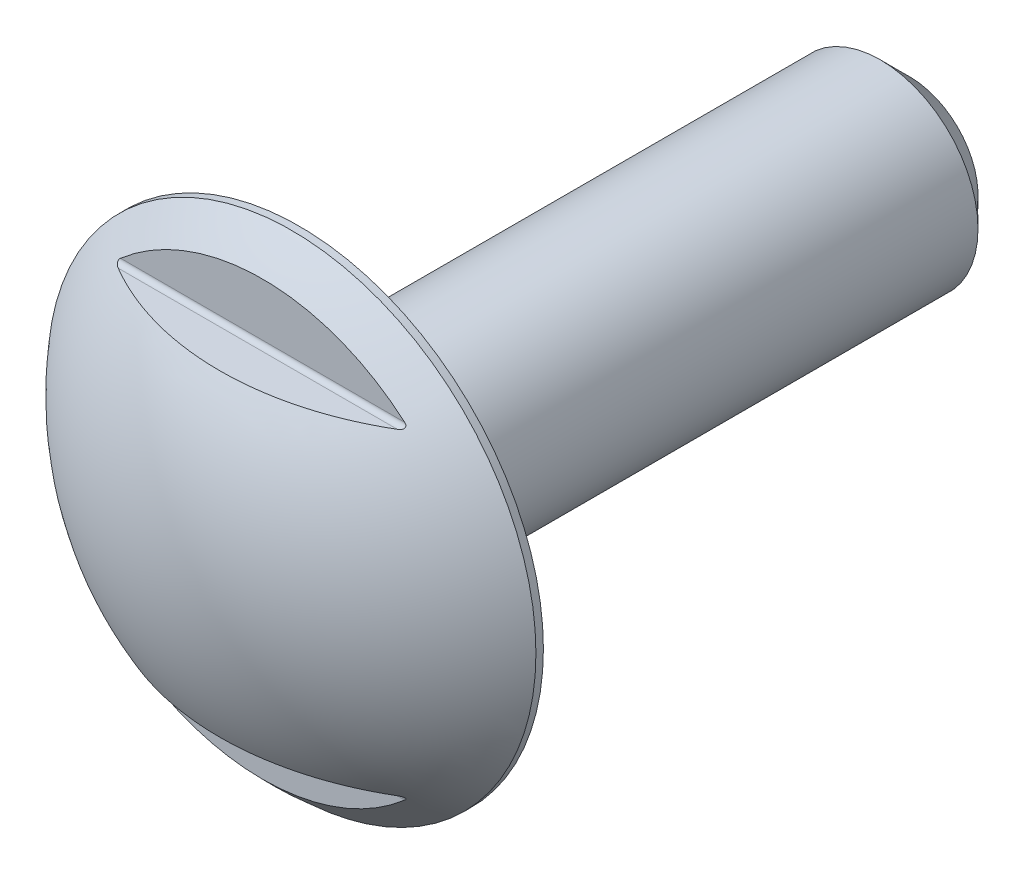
ISO-10303-21;
HEADER;
FILE_DESCRIPTION(('STEP AP214'),'2;1');
FILE_NAME('part.step','',(''),(''),'','','');
FILE_SCHEMA(('AUTOMOTIVE_DESIGN { 1 0 10303 214 1 1 1 1 }'));
ENDSEC;
DATA;
#1=APPLICATION_CONTEXT('core data for automotive mechanical design processes');
#2=APPLICATION_PROTOCOL_DEFINITION('international standard','automotive_design',2000,#1);
#3=PRODUCT_CONTEXT('',#1,'mechanical');
#4=PRODUCT('Part','Part','',(#3));
#5=PRODUCT_RELATED_PRODUCT_CATEGORY('part','',(#4));
#6=PRODUCT_DEFINITION_FORMATION('','',#4);
#7=PRODUCT_DEFINITION_CONTEXT('part definition',#1,'design');
#8=PRODUCT_DEFINITION('design','',#6,#7);
#9=PRODUCT_DEFINITION_SHAPE('','',#8);
#10=(LENGTH_UNIT() NAMED_UNIT(*) SI_UNIT(.MILLI.,.METRE.));
#11=(NAMED_UNIT(*) PLANE_ANGLE_UNIT() SI_UNIT($,.RADIAN.));
#12=(NAMED_UNIT(*) SI_UNIT($,.STERADIAN.) SOLID_ANGLE_UNIT());
#13=UNCERTAINTY_MEASURE_WITH_UNIT(LENGTH_MEASURE(1.E-05),#10,'distance_accuracy_value','');
#14=(GEOMETRIC_REPRESENTATION_CONTEXT(3) GLOBAL_UNCERTAINTY_ASSIGNED_CONTEXT((#13)) GLOBAL_UNIT_ASSIGNED_CONTEXT((#10,
#11,#12)) REPRESENTATION_CONTEXT('',''));
#15=CARTESIAN_POINT('',(0.,0.,0.));
#16=DIRECTION('',(0.,0.,1.));
#17=DIRECTION('',(1.,0.,0.));
#18=AXIS2_PLACEMENT_3D('',#15,#16,#17);
#19=CARTESIAN_POINT('',(0.,0.,-8.));
#20=DIRECTION('',(0.,0.,-1.));
#21=DIRECTION('',(0.,-1.,0.));
#22=AXIS2_PLACEMENT_3D('',#19,#20,#21);
#23=SPHERICAL_SURFACE('',#22,13.);
#24=CARTESIAN_POINT('',(5.71455323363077,-6.50000010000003,1.7002));
#25=CARTESIAN_POINT('',(5.72369421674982,-6.49999891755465,1.69481571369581));
#26=CARTESIAN_POINT('',(5.73277148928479,-6.50020699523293,1.68931126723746));
#27=CARTESIAN_POINT('',(5.75077060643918,-6.50112929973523,1.67801987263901));
#28=CARTESIAN_POINT('',(5.75969170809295,-6.50184549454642,1.67223190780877));
#29=CARTESIAN_POINT('',(5.77737661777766,-6.50388435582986,1.66030660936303));
#30=CARTESIAN_POINT('',(5.78613755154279,-6.50521371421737,1.65416609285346));
#31=CARTESIAN_POINT('',(5.80327525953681,-6.50861084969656,1.64158164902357));
#32=CARTESIAN_POINT('',(5.81165267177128,-6.51067734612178,1.63513826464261));
#33=CARTESIAN_POINT('',(5.82612016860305,-6.51519179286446,1.62333991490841));
#34=CARTESIAN_POINT('',(5.832315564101,-6.51746296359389,1.61804778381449));
#35=CARTESIAN_POINT('',(5.84422792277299,-6.52269970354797,1.60726079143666));
#36=CARTESIAN_POINT('',(5.8499449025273,-6.52566524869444,1.60176593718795));
#37=CARTESIAN_POINT('',(5.8607513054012,-6.53248829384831,1.59052992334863));
#38=CARTESIAN_POINT('',(5.86583153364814,-6.53635696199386,1.58478648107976));
#39=CARTESIAN_POINT('',(5.87489997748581,-6.54513797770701,1.57323308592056));
#40=CARTESIAN_POINT('',(5.87889217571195,-6.55004639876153,1.56742345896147));
#41=CARTESIAN_POINT('',(5.8840939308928,-6.55895625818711,1.55811489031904));
#42=CARTESIAN_POINT('',(5.8857861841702,-6.56261599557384,1.55456022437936));
#43=CARTESIAN_POINT('',(5.88840952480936,-6.57035151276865,1.54762498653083));
#44=CARTESIAN_POINT('',(5.88934135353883,-6.57442688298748,1.54424424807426));
#45=CARTESIAN_POINT('',(5.89035474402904,-6.58292472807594,1.53775927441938));
#46=CARTESIAN_POINT('',(5.89043231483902,-6.58734873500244,1.5346564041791));
#47=CARTESIAN_POINT('',(5.88971811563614,-6.59638433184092,1.52884899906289));
#48=CARTESIAN_POINT('',(5.88892602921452,-6.60099598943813,1.526144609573));
#49=CARTESIAN_POINT('',(5.88661801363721,-6.61000707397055,1.52132138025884));
#50=CARTESIAN_POINT('',(5.8851428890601,-6.61440472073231,1.51917902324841));
#51=CARTESIAN_POINT('',(5.88159909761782,-6.62313388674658,1.51529902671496));
#52=CARTESIAN_POINT('',(5.87953032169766,-6.62746539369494,1.51356146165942));
#53=CARTESIAN_POINT('',(5.87338299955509,-6.6388360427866,1.5094321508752));
#54=CARTESIAN_POINT('',(5.8688815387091,-6.64576555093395,1.50737089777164));
#55=CARTESIAN_POINT('',(5.85897930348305,-6.65918909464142,1.50408517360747));
#56=CARTESIAN_POINT('',(5.85357406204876,-6.66568073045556,1.50286502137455));
#57=CARTESIAN_POINT('',(5.84330256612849,-6.67695936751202,1.50126703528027));
#58=CARTESIAN_POINT('',(5.83854245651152,-6.6818288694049,1.50077004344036));
#59=CARTESIAN_POINT('',(5.82878697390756,-6.69123844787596,1.50013768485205));
#60=CARTESIAN_POINT('',(5.8237948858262,-6.69578163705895,1.49999827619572));
#61=CARTESIAN_POINT('',(5.81870415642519,-6.7002,1.50000010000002));
#62=B_SPLINE_CURVE_WITH_KNOTS('',3,(#24,#25,#26,#27,#28,#29,#30,#31,#32,#33,#34,#35,#36,#37,#38,
#39,#40,#41,#42,#43,#44,#45,#46,#47,#48,#49,#50,#51,#52,#53,#54,#55,#56,#57,#58,#59,#60,#61),
.UNSPECIFIED.,.F.,.F.,(4,2,2,2,2,2,2,2,2,2,2,2,2,2,2,2,2,2,4),(0.,0.0318328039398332,
0.0637895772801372,0.0961036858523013,0.128361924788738,0.153703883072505,0.179044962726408,
0.204717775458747,0.230295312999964,0.246359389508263,0.262407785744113,0.27853112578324,
0.2946603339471,0.309930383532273,0.325203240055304,0.350606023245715,0.376138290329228,
0.396599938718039,0.416829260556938),.UNSPECIFIED.);
#63=CARTESIAN_POINT('',(5.71489282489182,-6.5,1.7));
#64=VERTEX_POINT('',#63);
#65=CARTESIAN_POINT('',(5.81893461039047,-6.7,1.5));
#66=VERTEX_POINT('',#65);
#67=EDGE_CURVE('E65',#64,#66,#62,.T.);
#68=ORIENTED_EDGE('',*,*,#67,.T.);
#69=CARTESIAN_POINT('',(0.,0.,1.5));
#70=DIRECTION('',(0.,0.,1.));
#71=DIRECTION('',(-1.,0.,0.));
#72=AXIS2_PLACEMENT_3D('',#69,#70,#71);
#73=CIRCLE('',#72,8.87411967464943);
#74=CARTESIAN_POINT('',(-5.81893461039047,-6.7,1.5));
#75=VERTEX_POINT('',#74);
#76=EDGE_CURVE('E53',#66,#75,#73,.F.);
#77=ORIENTED_EDGE('',*,*,#76,.T.);
#78=CARTESIAN_POINT('',(-5.81870415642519,-6.7002,1.50000010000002));
#79=CARTESIAN_POINT('',(-5.82629700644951,-6.69359546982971,1.5000078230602));
#80=CARTESIAN_POINT('',(-5.8337158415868,-6.68669303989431,1.50031572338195));
#81=CARTESIAN_POINT('',(-5.84793411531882,-6.67213648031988,1.50180858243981));
#82=CARTESIAN_POINT('',(-5.85472041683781,-6.66447129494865,1.50300882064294));
#83=CARTESIAN_POINT('',(-5.86512205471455,-6.651028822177,1.50600903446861));
#84=CARTESIAN_POINT('',(-5.86905647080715,-6.64543415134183,1.5074933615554));
#85=CARTESIAN_POINT('',(-5.87613562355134,-6.63398909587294,1.51111281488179));
#86=CARTESIAN_POINT('',(-5.87928438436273,-6.62814020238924,1.51324449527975));
#87=CARTESIAN_POINT('',(-5.88396010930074,-6.61758139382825,1.51770242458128));
#88=CARTESIAN_POINT('',(-5.88569115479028,-6.61290212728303,1.51988416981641));
#89=CARTESIAN_POINT('',(-5.88837457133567,-6.60355515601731,1.5247117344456));
#90=CARTESIAN_POINT('',(-5.88932730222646,-6.59888744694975,1.52735733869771));
#91=CARTESIAN_POINT('',(-5.89035948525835,-6.58969138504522,1.53308251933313));
#92=CARTESIAN_POINT('',(-5.89043489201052,-6.58516377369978,1.53616403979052));
#93=CARTESIAN_POINT('',(-5.88969308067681,-6.57642454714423,1.54265085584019));
#94=CARTESIAN_POINT('',(-5.88887554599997,-6.57221304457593,1.54605626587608));
#95=CARTESIAN_POINT('',(-5.88651478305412,-6.56447623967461,1.55283316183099));
#96=CARTESIAN_POINT('',(-5.88502241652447,-6.56092408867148,1.55619234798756));
#97=CARTESIAN_POINT('',(-5.88144643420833,-6.55422204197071,1.56299049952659));
#98=CARTESIAN_POINT('',(-5.87936265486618,-6.55107225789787,1.56642948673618));
#99=CARTESIAN_POINT('',(-5.87315851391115,-6.54318228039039,1.57563821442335));
#100=CARTESIAN_POINT('',(-5.86861046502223,-6.5387953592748,1.58142154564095));
#101=CARTESIAN_POINT('',(-5.8586215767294,-6.53097427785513,1.59286202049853));
#102=CARTESIAN_POINT('',(-5.85317780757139,-6.52754334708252,1.59851867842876));
#103=CARTESIAN_POINT('',(-5.83713343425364,-6.51904567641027,1.61406010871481));
#104=CARTESIAN_POINT('',(-5.82587402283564,-6.51484720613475,1.62373070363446));
#105=CARTESIAN_POINT('',(-5.80233765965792,-6.50821128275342,1.64242201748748));
#106=CARTESIAN_POINT('',(-5.79005692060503,-6.50578074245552,1.65144006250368));
#107=CARTESIAN_POINT('',(-5.76725069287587,-6.50256854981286,1.66724254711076));
#108=CARTESIAN_POINT('',(-5.75682527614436,-6.50156384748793,1.67412977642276));
#109=CARTESIAN_POINT('',(-5.73580990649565,-6.50028426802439,1.68746318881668));
#110=CARTESIAN_POINT('',(-5.72522298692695,-6.50000155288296,1.69391336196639));
#111=CARTESIAN_POINT('',(-5.71455323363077,-6.50000010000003,1.7002));
#112=B_SPLINE_CURVE_WITH_KNOTS('',3,(#78,#79,#80,#81,#82,#83,#84,#85,#86,#87,#88,#89,#90,#91,
#92,#93,#94,#95,#96,#97,#98,#99,#100,#101,#102,#103,#104,#105,#106,#107,#108,#109,#110,#111),
.UNSPECIFIED.,.F.,.F.,(4,2,2,2,2,2,2,2,2,2,2,2,2,2,2,2,4),(0.,0.0302839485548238,
0.0610987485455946,0.0820341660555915,0.102860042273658,0.119131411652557,0.135395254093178,
0.15173406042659,0.168078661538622,0.183356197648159,0.198637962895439,0.224186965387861,
0.249821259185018,0.295836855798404,0.342031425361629,0.379606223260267,0.41677133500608),.UNSPECIFIED.);
#113=CARTESIAN_POINT('',(-5.71489282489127,-6.5,1.7));
#114=VERTEX_POINT('',#113);
#115=EDGE_CURVE('E58',#75,#114,#112,.T.);
#116=ORIENTED_EDGE('',*,*,#115,.T.);
#117=CARTESIAN_POINT('',(0.,-6.5,-8.));
#118=DIRECTION('',(0.,-1.,0.));
#119=DIRECTION('',(0.,0.,1.));
#120=AXIS2_PLACEMENT_3D('',#117,#118,#119);
#121=CIRCLE('',#120,11.2583302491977);
#122=EDGE_CURVE('E70',#114,#64,#121,.F.);
#123=ORIENTED_EDGE('',*,*,#122,.T.);
#124=EDGE_LOOP('',(#68,#77,#116,#123));
#125=FACE_BOUND('',#124,.T.);
#126=CARTESIAN_POINT('',(0.,0.,0.306623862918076));
#127=DIRECTION('',(0.,0.,-1.));
#128=DIRECTION('',(1.,0.,0.));
#129=AXIS2_PLACEMENT_3D('',#126,#127,#128);
#130=CIRCLE('',#129,10.);
#131=CARTESIAN_POINT('',(10.,0.,0.306623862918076));
#132=VERTEX_POINT('',#131);
#133=EDGE_CURVE('E59',#132,#132,#130,.T.);
#134=ORIENTED_EDGE('',*,*,#133,.F.);
#135=EDGE_LOOP('',(#134));
#136=FACE_BOUND('',#135,.T.);
#137=CARTESIAN_POINT('',(-5.71455323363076,6.50000010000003,1.7002));
#138=CARTESIAN_POINT('',(-5.72369421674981,6.49999891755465,1.69481571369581));
#139=CARTESIAN_POINT('',(-5.73277148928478,6.50020699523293,1.68931126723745));
#140=CARTESIAN_POINT('',(-5.75077060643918,6.50112929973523,1.67801987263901));
#141=CARTESIAN_POINT('',(-5.75969170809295,6.50184549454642,1.67223190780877));
#142=CARTESIAN_POINT('',(-5.77737661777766,6.50388435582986,1.66030660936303));
#143=CARTESIAN_POINT('',(-5.78613755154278,6.50521371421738,1.65416609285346));
#144=CARTESIAN_POINT('',(-5.8032752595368,6.50861084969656,1.64158164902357));
#145=CARTESIAN_POINT('',(-5.81165267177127,6.51067734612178,1.63513826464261));
#146=CARTESIAN_POINT('',(-5.82612016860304,6.51519179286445,1.62333991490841));
#147=CARTESIAN_POINT('',(-5.83231556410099,6.51746296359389,1.61804778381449));
#148=CARTESIAN_POINT('',(-5.84422792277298,6.52269970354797,1.60726079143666));
#149=CARTESIAN_POINT('',(-5.84994490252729,6.52566524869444,1.60176593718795));
#150=CARTESIAN_POINT('',(-5.86075130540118,6.53248829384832,1.59052992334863));
#151=CARTESIAN_POINT('',(-5.86583153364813,6.53635696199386,1.58478648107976));
#152=CARTESIAN_POINT('',(-5.8748999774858,6.54513797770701,1.57323308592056));
#153=CARTESIAN_POINT('',(-5.87889217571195,6.55004639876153,1.56742345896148));
#154=CARTESIAN_POINT('',(-5.8840939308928,6.55895625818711,1.55811489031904));
#155=CARTESIAN_POINT('',(-5.8857861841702,6.56261599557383,1.55456022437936));
#156=CARTESIAN_POINT('',(-5.88840952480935,6.57035151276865,1.54762498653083));
#157=CARTESIAN_POINT('',(-5.88934135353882,6.57442688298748,1.54424424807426));
#158=CARTESIAN_POINT('',(-5.89035474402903,6.58292472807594,1.53775927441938));
#159=CARTESIAN_POINT('',(-5.89043231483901,6.58734873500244,1.5346564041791));
#160=CARTESIAN_POINT('',(-5.88971811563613,6.59638433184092,1.52884899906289));
#161=CARTESIAN_POINT('',(-5.88892602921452,6.60099598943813,1.526144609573));
#162=CARTESIAN_POINT('',(-5.88661801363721,6.61000707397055,1.52132138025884));
#163=CARTESIAN_POINT('',(-5.88514288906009,6.61440472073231,1.51917902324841));
#164=CARTESIAN_POINT('',(-5.88159909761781,6.62313388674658,1.51529902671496));
#165=CARTESIAN_POINT('',(-5.87953032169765,6.62746539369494,1.51356146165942));
#166=CARTESIAN_POINT('',(-5.87338299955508,6.6388360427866,1.5094321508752));
#167=CARTESIAN_POINT('',(-5.86888153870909,6.64576555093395,1.50737089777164));
#168=CARTESIAN_POINT('',(-5.85897930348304,6.65918909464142,1.50408517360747));
#169=CARTESIAN_POINT('',(-5.85357406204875,6.66568073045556,1.50286502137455));
#170=CARTESIAN_POINT('',(-5.84330256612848,6.67695936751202,1.50126703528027));
#171=CARTESIAN_POINT('',(-5.83854245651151,6.6818288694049,1.50077004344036));
#172=CARTESIAN_POINT('',(-5.82878697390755,6.69123844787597,1.50013768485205));
#173=CARTESIAN_POINT('',(-5.82379488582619,6.69578163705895,1.49999827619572));
#174=CARTESIAN_POINT('',(-5.81870415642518,6.7002,1.50000010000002));
#175=B_SPLINE_CURVE_WITH_KNOTS('',3,(#137,#138,#139,#140,#141,#142,#143,#144,#145,#146,#147,
#148,#149,#150,#151,#152,#153,#154,#155,#156,#157,#158,#159,#160,#161,#162,#163,#164,#165,#166,
#167,#168,#169,#170,#171,#172,#173,#174),.UNSPECIFIED.,.F.,.F.,(4,2,2,2,2,2,2,2,2,2,2,2,2,2,2,2,
2,2,4),(0.,0.0318328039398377,0.0637895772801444,0.0961036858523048,0.128361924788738,
0.153703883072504,0.179044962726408,0.204717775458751,0.23029531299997,0.246359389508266,
0.262407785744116,0.278531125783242,0.294660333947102,0.309930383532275,0.325203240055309,
0.350606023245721,0.376138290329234,0.396599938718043,0.416829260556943),.UNSPECIFIED.);
#176=CARTESIAN_POINT('',(-5.71489282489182,6.5,1.7));
#177=VERTEX_POINT('',#176);
#178=CARTESIAN_POINT('',(-5.81893461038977,6.7,1.5));
#179=VERTEX_POINT('',#178);
#180=EDGE_CURVE('E116',#177,#179,#175,.T.);
#181=ORIENTED_EDGE('',*,*,#180,.T.);
#182=CARTESIAN_POINT('',(0.,0.,1.5));
#183=DIRECTION('',(0.,0.,1.));
#184=DIRECTION('',(-1.,0.,0.));
#185=AXIS2_PLACEMENT_3D('',#182,#183,#184);
#186=CIRCLE('',#185,8.87411967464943);
#187=CARTESIAN_POINT('',(5.81893461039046,6.7,1.5));
#188=VERTEX_POINT('',#187);
#189=EDGE_CURVE('E123',#179,#188,#186,.F.);
#190=ORIENTED_EDGE('',*,*,#189,.T.);
#191=CARTESIAN_POINT('',(5.81870415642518,6.7002,1.50000010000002));
#192=CARTESIAN_POINT('',(5.8262970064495,6.69359546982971,1.5000078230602));
#193=CARTESIAN_POINT('',(5.83371584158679,6.68669303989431,1.50031572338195));
#194=CARTESIAN_POINT('',(5.84793411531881,6.67213648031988,1.50180858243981));
#195=CARTESIAN_POINT('',(5.8547204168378,6.66447129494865,1.50300882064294));
#196=CARTESIAN_POINT('',(5.86512205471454,6.651028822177,1.50600903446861));
#197=CARTESIAN_POINT('',(5.86905647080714,6.64543415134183,1.5074933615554));
#198=CARTESIAN_POINT('',(5.87613562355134,6.63398909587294,1.51111281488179));
#199=CARTESIAN_POINT('',(5.87928438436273,6.62814020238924,1.51324449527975));
#200=CARTESIAN_POINT('',(5.88396010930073,6.61758139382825,1.51770242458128));
#201=CARTESIAN_POINT('',(5.88569115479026,6.61290212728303,1.51988416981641));
#202=CARTESIAN_POINT('',(5.88837457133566,6.60355515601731,1.5247117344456));
#203=CARTESIAN_POINT('',(5.88932730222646,6.59888744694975,1.52735733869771));
#204=CARTESIAN_POINT('',(5.89035948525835,6.58969138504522,1.53308251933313));
#205=CARTESIAN_POINT('',(5.89043489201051,6.58516377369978,1.53616403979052));
#206=CARTESIAN_POINT('',(5.88969308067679,6.57642454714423,1.54265085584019));
#207=CARTESIAN_POINT('',(5.88887554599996,6.57221304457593,1.54605626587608));
#208=CARTESIAN_POINT('',(5.88651478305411,6.56447623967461,1.55283316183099));
#209=CARTESIAN_POINT('',(5.88502241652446,6.56092408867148,1.55619234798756));
#210=CARTESIAN_POINT('',(5.88144643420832,6.55422204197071,1.56299049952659));
#211=CARTESIAN_POINT('',(5.87936265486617,6.55107225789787,1.56642948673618));
#212=CARTESIAN_POINT('',(5.87315851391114,6.54318228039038,1.57563821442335));
#213=CARTESIAN_POINT('',(5.86861046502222,6.5387953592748,1.58142154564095));
#214=CARTESIAN_POINT('',(5.85862157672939,6.53097427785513,1.59286202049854));
#215=CARTESIAN_POINT('',(5.85317780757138,6.52754334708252,1.59851867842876));
#216=CARTESIAN_POINT('',(5.83713343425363,6.51904567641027,1.61406010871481));
#217=CARTESIAN_POINT('',(5.82587402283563,6.51484720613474,1.62373070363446));
#218=CARTESIAN_POINT('',(5.80233765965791,6.50821128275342,1.64242201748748));
#219=CARTESIAN_POINT('',(5.79005692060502,6.50578074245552,1.65144006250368));
#220=CARTESIAN_POINT('',(5.76725069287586,6.50256854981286,1.66724254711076));
#221=CARTESIAN_POINT('',(5.75682527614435,6.50156384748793,1.67412977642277));
#222=CARTESIAN_POINT('',(5.73580990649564,6.50028426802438,1.68746318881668));
#223=CARTESIAN_POINT('',(5.72522298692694,6.50000155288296,1.69391336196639));
#224=CARTESIAN_POINT('',(5.71455323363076,6.50000010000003,1.7002));
#225=B_SPLINE_CURVE_WITH_KNOTS('',3,(#191,#192,#193,#194,#195,#196,#197,#198,#199,#200,#201,
#202,#203,#204,#205,#206,#207,#208,#209,#210,#211,#212,#213,#214,#215,#216,#217,#218,#219,#220,
#221,#222,#223,#224),.UNSPECIFIED.,.F.,.F.,(4,2,2,2,2,2,2,2,2,2,2,2,2,2,2,2,4),(0.,
0.0302839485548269,0.0610987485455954,0.082034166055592,0.102860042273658,0.119131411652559,
0.13539525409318,0.151734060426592,0.168078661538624,0.183356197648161,0.19863796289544,
0.224186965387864,0.24982125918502,0.295836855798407,0.342031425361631,0.37960622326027,
0.416771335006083),.UNSPECIFIED.);
#226=CARTESIAN_POINT('',(5.71489282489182,6.5,1.7));
#227=VERTEX_POINT('',#226);
#228=EDGE_CURVE('E110',#188,#227,#225,.T.);
#229=ORIENTED_EDGE('',*,*,#228,.T.);
#230=CARTESIAN_POINT('',(0.,6.5,-8.));
#231=DIRECTION('',(0.,1.,0.));
#232=DIRECTION('',(0.,0.,-1.));
#233=AXIS2_PLACEMENT_3D('',#230,#231,#232);
#234=CIRCLE('',#233,11.2583302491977);
#235=EDGE_CURVE('E72',#227,#177,#234,.F.);
#236=ORIENTED_EDGE('',*,*,#235,.T.);
#237=EDGE_LOOP('',(#181,#190,#229,#236));
#238=FACE_BOUND('',#237,.T.);
#239=ADVANCED_FACE('F14',(#125,#136,#238),#23,.T.);
#240=CARTESIAN_POINT('',(0.,0.,-12.));
#241=DIRECTION('',(0.,0.,-1.));
#242=DIRECTION('',(1.,0.,0.));
#243=AXIS2_PLACEMENT_3D('',#240,#241,#242);
#244=CYLINDRICAL_SURFACE('',#243,10.);
#245=CARTESIAN_POINT('',(0.,0.,0.));
#246=DIRECTION('',(0.,0.,-1.));
#247=DIRECTION('',(1.,0.,0.));
#248=AXIS2_PLACEMENT_3D('',#245,#246,#247);
#249=CIRCLE('',#248,10.);
#250=CARTESIAN_POINT('',(10.,0.,0.));
#251=VERTEX_POINT('',#250);
#252=EDGE_CURVE('E194',#251,#251,#249,.T.);
#253=ORIENTED_EDGE('',*,*,#252,.F.);
#254=EDGE_LOOP('',(#253));
#255=FACE_BOUND('',#254,.T.);
#256=ORIENTED_EDGE('',*,*,#133,.T.);
#257=EDGE_LOOP('',(#256));
#258=FACE_BOUND('',#257,.T.);
#259=ADVANCED_FACE('F137',(#255,#258),#244,.T.);
#260=CARTESIAN_POINT('',(0.,-10.,0.));
#261=DIRECTION('',(0.,0.,1.));
#262=DIRECTION('',(-1.,0.,0.));
#263=AXIS2_PLACEMENT_3D('',#260,#261,#262);
#264=PLANE('',#263);
#265=CARTESIAN_POINT('',(0.,0.,0.));
#266=DIRECTION('',(0.,0.,-1.));
#267=DIRECTION('',(1.,0.,0.));
#268=AXIS2_PLACEMENT_3D('',#265,#266,#267);
#269=CIRCLE('',#268,3.6);
#270=CARTESIAN_POINT('',(3.6,0.,0.));
#271=VERTEX_POINT('',#270);
#272=EDGE_CURVE('E191',#271,#271,#269,.T.);
#273=ORIENTED_EDGE('',*,*,#272,.F.);
#274=EDGE_LOOP('',(#273));
#275=FACE_BOUND('',#274,.T.);
#276=ORIENTED_EDGE('',*,*,#252,.T.);
#277=EDGE_LOOP('',(#276));
#278=FACE_BOUND('',#277,.T.);
#279=ADVANCED_FACE('F141',(#275,#278),#264,.F.);
#280=CARTESIAN_POINT('',(0.,0.,-0.6));
#281=DIRECTION('',(0.,0.,-1.));
#282=DIRECTION('',(1.,0.,0.));
#283=AXIS2_PLACEMENT_3D('',#280,#281,#282);
#284=TOROIDAL_SURFACE('',#283,3.6,0.6);
#285=CARTESIAN_POINT('',(0.,0.,-0.6));
#286=DIRECTION('',(0.,0.,-1.));
#287=DIRECTION('',(1.,0.,0.));
#288=AXIS2_PLACEMENT_3D('',#285,#286,#287);
#289=CIRCLE('',#288,3.);
#290=CARTESIAN_POINT('',(3.,0.,-0.6));
#291=VERTEX_POINT('',#290);
#292=EDGE_CURVE('E188',#291,#291,#289,.T.);
#293=ORIENTED_EDGE('',*,*,#292,.F.);
#294=EDGE_LOOP('',(#293));
#295=FACE_BOUND('',#294,.T.);
#296=ORIENTED_EDGE('',*,*,#272,.T.);
#297=EDGE_LOOP('',(#296));
#298=FACE_BOUND('',#297,.T.);
#299=ADVANCED_FACE('F146',(#295,#298),#284,.F.);
#300=CARTESIAN_POINT('',(0.,0.,-12.));
#301=DIRECTION('',(0.,0.,-1.));
#302=DIRECTION('',(1.,0.,0.));
#303=AXIS2_PLACEMENT_3D('',#300,#301,#302);
#304=CYLINDRICAL_SURFACE('',#303,3.);
#305=CARTESIAN_POINT('',(0.,0.,-0.807179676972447));
#306=DIRECTION('',(0.,0.,-1.));
#307=DIRECTION('',(1.,0.,0.));
#308=AXIS2_PLACEMENT_3D('',#305,#306,#307);
#309=CIRCLE('',#308,3.);
#310=CARTESIAN_POINT('',(3.,0.,-0.807179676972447));
#311=VERTEX_POINT('',#310);
#312=EDGE_CURVE('E180',#311,#311,#309,.T.);
#313=ORIENTED_EDGE('',*,*,#312,.F.);
#314=EDGE_LOOP('',(#313));
#315=FACE_BOUND('',#314,.T.);
#316=ORIENTED_EDGE('',*,*,#292,.T.);
#317=EDGE_LOOP('',(#316));
#318=FACE_BOUND('',#317,.T.);
#319=ADVANCED_FACE('F154',(#315,#318),#304,.T.);
#320=CARTESIAN_POINT('',(0.,0.,-0.80717967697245));
#321=DIRECTION('',(0.,0.,-1.));
#322=DIRECTION('',(1.,0.,0.));
#323=AXIS2_PLACEMENT_3D('',#320,#321,#322);
#324=TOROIDAL_SURFACE('',#323,3.6,0.6);
#325=CARTESIAN_POINT('',(0.,0.,-1.10717967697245));
#326=DIRECTION('',(0.,0.,-1.));
#327=DIRECTION('',(1.,0.,0.));
#328=AXIS2_PLACEMENT_3D('',#325,#326,#327);
#329=CIRCLE('',#328,3.08038475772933);
#330=CARTESIAN_POINT('',(3.08038475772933,0.,-1.10717967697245));
#331=VERTEX_POINT('',#330);
#332=EDGE_CURVE('E176',#331,#331,#329,.T.);
#333=ORIENTED_EDGE('',*,*,#332,.F.);
#334=EDGE_LOOP('',(#333));
#335=FACE_BOUND('',#334,.T.);
#336=ORIENTED_EDGE('',*,*,#312,.T.);
#337=EDGE_LOOP('',(#336));
#338=FACE_BOUND('',#337,.T.);
#339=ADVANCED_FACE('F158',(#335,#338),#324,.F.);
#340=CARTESIAN_POINT('',(0.,0.,-1.10717967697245));
#341=DIRECTION('',(0.,0.,-1.));
#342=DIRECTION('',(1.,0.,0.));
#343=AXIS2_PLACEMENT_3D('',#340,#341,#342);
#344=CONICAL_SURFACE('',#343,3.08038475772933,0.523598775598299);
#345=CARTESIAN_POINT('',(0.,0.,-2.7));
#346=DIRECTION('',(0.,0.,-1.));
#347=DIRECTION('',(1.,0.,0.));
#348=AXIS2_PLACEMENT_3D('',#345,#346,#347);
#349=CIRCLE('',#348,4.);
#350=CARTESIAN_POINT('',(4.,0.,-2.7));
#351=VERTEX_POINT('',#350);
#352=EDGE_CURVE('E175',#351,#351,#349,.T.);
#353=ORIENTED_EDGE('',*,*,#352,.F.);
#354=EDGE_LOOP('',(#353));
#355=FACE_BOUND('',#354,.T.);
#356=ORIENTED_EDGE('',*,*,#332,.T.);
#357=EDGE_LOOP('',(#356));
#358=FACE_BOUND('',#357,.T.);
#359=ADVANCED_FACE('F162',(#355,#358),#344,.T.);
#360=CARTESIAN_POINT('',(0.,0.,-12.));
#361=DIRECTION('',(0.,0.,-1.));
#362=DIRECTION('',(1.,0.,0.));
#363=AXIS2_PLACEMENT_3D('',#360,#361,#362);
#364=CYLINDRICAL_SURFACE('',#363,4.);
#365=CARTESIAN_POINT('',(0.,0.,-23.8));
#366=DIRECTION('',(0.,0.,-1.));
#367=DIRECTION('',(-1.,0.,0.));
#368=AXIS2_PLACEMENT_3D('',#365,#366,#367);
#369=CIRCLE('',#368,4.);
#370=CARTESIAN_POINT('',(-4.,0.,-23.8));
#371=VERTEX_POINT('',#370);
#372=EDGE_CURVE('E9',#371,#371,#369,.F.);
#373=ORIENTED_EDGE('',*,*,#372,.T.);
#374=EDGE_LOOP('',(#373));
#375=FACE_BOUND('',#374,.T.);
#376=ORIENTED_EDGE('',*,*,#352,.T.);
#377=EDGE_LOOP('',(#376));
#378=FACE_BOUND('',#377,.T.);
#379=ADVANCED_FACE('F165',(#375,#378),#364,.T.);
#380=CARTESIAN_POINT('',(-12.,-6.7,1.5));
#381=DIRECTION('',(0.,0.,1.));
#382=DIRECTION('',(-1.,0.,0.));
#383=AXIS2_PLACEMENT_3D('',#380,#381,#382);
#384=PLANE('',#383);
#385=DIRECTION('',(1.,0.,0.));
#386=VECTOR('',#385,1.);
#387=CARTESIAN_POINT('',(-12.,-6.7,1.5));
#388=LINE('',#387,#386);
#389=EDGE_CURVE('E35',#75,#66,#388,.T.);
#390=ORIENTED_EDGE('',*,*,#389,.F.);
#391=ORIENTED_EDGE('',*,*,#76,.F.);
#392=EDGE_LOOP('',(#390,#391));
#393=FACE_BOUND('',#392,.T.);
#394=ADVANCED_FACE('F54',(#393),#384,.T.);
#395=CARTESIAN_POINT('',(-12.,-6.7,1.7));
#396=DIRECTION('',(1.,0.,0.));
#397=DIRECTION('',(0.,1.,0.));
#398=AXIS2_PLACEMENT_3D('',#395,#396,#397);
#399=CYLINDRICAL_SURFACE('',#398,0.2);
#400=DIRECTION('',(1.,0.,0.));
#401=VECTOR('',#400,1.);
#402=CARTESIAN_POINT('',(-12.,-6.5,1.7));
#403=LINE('',#402,#401);
#404=EDGE_CURVE('E67',#114,#64,#403,.T.);
#405=ORIENTED_EDGE('',*,*,#404,.F.);
#406=ORIENTED_EDGE('',*,*,#115,.F.);
#407=ORIENTED_EDGE('',*,*,#389,.T.);
#408=ORIENTED_EDGE('',*,*,#67,.F.);
#409=EDGE_LOOP('',(#405,#406,#407,#408));
#410=FACE_BOUND('',#409,.T.);
#411=ADVANCED_FACE('F64',(#410),#399,.F.);
#412=CARTESIAN_POINT('',(-12.,-6.5,5.));
#413=DIRECTION('',(0.,-1.,0.));
#414=DIRECTION('',(0.,0.,1.));
#415=AXIS2_PLACEMENT_3D('',#412,#413,#414);
#416=PLANE('',#415);
#417=ORIENTED_EDGE('',*,*,#122,.F.);
#418=ORIENTED_EDGE('',*,*,#404,.T.);
#419=EDGE_LOOP('',(#417,#418));
#420=FACE_BOUND('',#419,.T.);
#421=ADVANCED_FACE('F91',(#420),#416,.T.);
#422=CARTESIAN_POINT('',(-12.,15.,1.5));
#423=DIRECTION('',(0.,0.,1.));
#424=DIRECTION('',(-1.,0.,0.));
#425=AXIS2_PLACEMENT_3D('',#422,#423,#424);
#426=PLANE('',#425);
#427=DIRECTION('',(1.,0.,0.));
#428=VECTOR('',#427,1.);
#429=CARTESIAN_POINT('',(-12.,6.7,1.5));
#430=LINE('',#429,#428);
#431=EDGE_CURVE('E177',#179,#188,#430,.T.);
#432=ORIENTED_EDGE('',*,*,#431,.T.);
#433=ORIENTED_EDGE('',*,*,#189,.F.);
#434=EDGE_LOOP('',(#432,#433));
#435=FACE_BOUND('',#434,.T.);
#436=ADVANCED_FACE('F96',(#435),#426,.T.);
#437=CARTESIAN_POINT('',(-12.,6.7,1.7));
#438=DIRECTION('',(1.,0.,0.));
#439=DIRECTION('',(0.,1.,0.));
#440=AXIS2_PLACEMENT_3D('',#437,#438,#439);
#441=CYLINDRICAL_SURFACE('',#440,0.2);
#442=DIRECTION('',(1.,0.,0.));
#443=VECTOR('',#442,1.);
#444=CARTESIAN_POINT('',(-12.,6.5,1.7));
#445=LINE('',#444,#443);
#446=EDGE_CURVE('E28',#177,#227,#445,.T.);
#447=ORIENTED_EDGE('',*,*,#446,.T.);
#448=ORIENTED_EDGE('',*,*,#228,.F.);
#449=ORIENTED_EDGE('',*,*,#431,.F.);
#450=ORIENTED_EDGE('',*,*,#180,.F.);
#451=EDGE_LOOP('',(#447,#448,#449,#450));
#452=FACE_BOUND('',#451,.T.);
#453=ADVANCED_FACE('F102',(#452),#441,.F.);
#454=CARTESIAN_POINT('',(-12.,6.5,1.7));
#455=DIRECTION('',(0.,1.,0.));
#456=DIRECTION('',(0.,0.,-1.));
#457=AXIS2_PLACEMENT_3D('',#454,#455,#456);
#458=PLANE('',#457);
#459=ORIENTED_EDGE('',*,*,#446,.F.);
#460=ORIENTED_EDGE('',*,*,#235,.F.);
#461=EDGE_LOOP('',(#459,#460));
#462=FACE_BOUND('',#461,.T.);
#463=ADVANCED_FACE('F98',(#462),#458,.T.);
#464=CARTESIAN_POINT('',(0.,0.,-25.));
#465=DIRECTION('',(0.,0.,-1.));
#466=DIRECTION('',(-1.,0.,0.));
#467=AXIS2_PLACEMENT_3D('',#464,#465,#466);
#468=PLANE('',#467);
#469=CARTESIAN_POINT('',(0.,0.,-25.));
#470=DIRECTION('',(0.,0.,-1.));
#471=DIRECTION('',(-1.,0.,0.));
#472=AXIS2_PLACEMENT_3D('',#469,#470,#471);
#473=CIRCLE('',#472,2.8);
#474=CARTESIAN_POINT('',(-2.8,0.,-25.));
#475=VERTEX_POINT('',#474);
#476=EDGE_CURVE('E22',#475,#475,#473,.T.);
#477=ORIENTED_EDGE('',*,*,#476,.T.);
#478=EDGE_LOOP('',(#477));
#479=FACE_BOUND('',#478,.T.);
#480=ADVANCED_FACE('F101',(#479),#468,.T.);
#481=CARTESIAN_POINT('',(0.,0.,-25.));
#482=DIRECTION('',(0.,0.,1.));
#483=DIRECTION('',(1.,0.,0.));
#484=AXIS2_PLACEMENT_3D('',#481,#482,#483);
#485=CONICAL_SURFACE('',#484,2.8,0.785398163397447);
#486=ORIENTED_EDGE('',*,*,#372,.F.);
#487=EDGE_LOOP('',(#486));
#488=FACE_BOUND('',#487,.T.);
#489=ORIENTED_EDGE('',*,*,#476,.F.);
#490=EDGE_LOOP('',(#489));
#491=FACE_BOUND('',#490,.T.);
#492=ADVANCED_FACE('F16',(#488,#491),#485,.T.);
#493=CLOSED_SHELL('',(#239,#259,#279,#299,#319,#339,#359,#379,#394,#411,#421,#436,#453,#463,
#480,#492));
#494=MANIFOLD_SOLID_BREP('B1',#493);
#495=ADVANCED_BREP_SHAPE_REPRESENTATION('',(#18,#494),#14);
#496=SHAPE_DEFINITION_REPRESENTATION(#9,#495);
ENDSEC;
END-ISO-10303-21;
